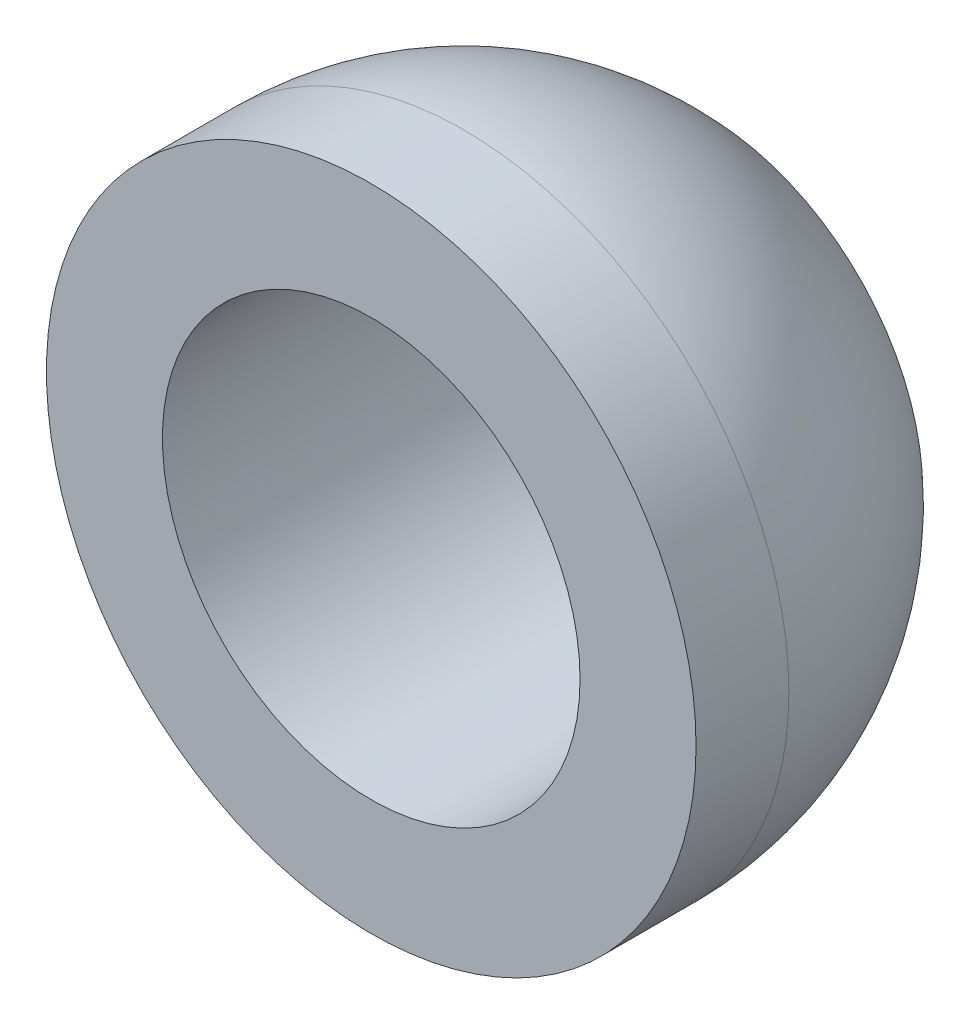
ISO-10303-21;
HEADER;
FILE_DESCRIPTION(('STEP AP214'),'2;1');
FILE_NAME('part.step','',(''),(''),'','','');
FILE_SCHEMA(('AUTOMOTIVE_DESIGN { 1 0 10303 214 1 1 1 1 }'));
ENDSEC;
DATA;
#1=APPLICATION_CONTEXT('core data for automotive mechanical design processes');
#2=APPLICATION_PROTOCOL_DEFINITION('international standard','automotive_design',2000,#1);
#3=PRODUCT_CONTEXT('',#1,'mechanical');
#4=PRODUCT('Part','Part','',(#3));
#5=PRODUCT_RELATED_PRODUCT_CATEGORY('part','',(#4));
#6=PRODUCT_DEFINITION_FORMATION('','',#4);
#7=PRODUCT_DEFINITION_CONTEXT('part definition',#1,'design');
#8=PRODUCT_DEFINITION('design','',#6,#7);
#9=PRODUCT_DEFINITION_SHAPE('','',#8);
#10=(LENGTH_UNIT() NAMED_UNIT(*) SI_UNIT(.MILLI.,.METRE.));
#11=(NAMED_UNIT(*) PLANE_ANGLE_UNIT() SI_UNIT($,.RADIAN.));
#12=(NAMED_UNIT(*) SI_UNIT($,.STERADIAN.) SOLID_ANGLE_UNIT());
#13=UNCERTAINTY_MEASURE_WITH_UNIT(LENGTH_MEASURE(1.E-05),#10,'distance_accuracy_value','');
#14=(GEOMETRIC_REPRESENTATION_CONTEXT(3) GLOBAL_UNCERTAINTY_ASSIGNED_CONTEXT((#13)) GLOBAL_UNIT_ASSIGNED_CONTEXT((#10,
#11,#12)) REPRESENTATION_CONTEXT('',''));
#15=CARTESIAN_POINT('',(0.,0.,0.));
#16=DIRECTION('',(0.,0.,1.));
#17=DIRECTION('',(1.,0.,0.));
#18=AXIS2_PLACEMENT_3D('',#15,#16,#17);
#19=CARTESIAN_POINT('',(0.,2.25,0.));
#20=DIRECTION('',(0.,0.,-1.));
#21=DIRECTION('',(-1.,0.,0.));
#22=AXIS2_PLACEMENT_3D('',#19,#20,#21);
#23=PLANE('',#22);
#24=CARTESIAN_POINT('',(0.,0.,0.));
#25=DIRECTION('',(0.,0.,1.));
#26=DIRECTION('',(1.,0.,0.));
#27=AXIS2_PLACEMENT_3D('',#24,#25,#26);
#28=CIRCLE('',#27,2.25);
#29=CARTESIAN_POINT('',(2.25,0.,0.));
#30=VERTEX_POINT('',#29);
#31=EDGE_CURVE('E10',#30,#30,#28,.T.);
#32=ORIENTED_EDGE('',*,*,#31,.F.);
#33=EDGE_LOOP('',(#32));
#34=FACE_BOUND('',#33,.T.);
#35=CARTESIAN_POINT('',(0.,0.,0.));
#36=DIRECTION('',(0.,0.,1.));
#37=DIRECTION('',(1.,0.,0.));
#38=AXIS2_PLACEMENT_3D('',#35,#36,#37);
#39=CIRCLE('',#38,3.5);
#40=CARTESIAN_POINT('',(3.5,0.,0.));
#41=VERTEX_POINT('',#40);
#42=EDGE_CURVE('E36',#41,#41,#39,.T.);
#43=ORIENTED_EDGE('',*,*,#42,.T.);
#44=EDGE_LOOP('',(#43));
#45=FACE_BOUND('',#44,.T.);
#46=ADVANCED_FACE('F25',(#34,#45),#23,.F.);
#47=CARTESIAN_POINT('',(0.,0.,0.));
#48=DIRECTION('',(0.,0.,1.));
#49=DIRECTION('',(1.,0.,0.));
#50=AXIS2_PLACEMENT_3D('',#47,#48,#49);
#51=CYLINDRICAL_SURFACE('',#50,2.25);
#52=CARTESIAN_POINT('',(0.,0.,-3.6));
#53=DIRECTION('',(0.,0.,1.));
#54=DIRECTION('',(1.,0.,0.));
#55=AXIS2_PLACEMENT_3D('',#52,#53,#54);
#56=CIRCLE('',#55,2.25);
#57=CARTESIAN_POINT('',(2.25,0.,-3.6));
#58=VERTEX_POINT('',#57);
#59=EDGE_CURVE('E41',#58,#58,#56,.F.);
#60=ORIENTED_EDGE('',*,*,#59,.T.);
#61=EDGE_LOOP('',(#60));
#62=FACE_BOUND('',#61,.T.);
#63=ORIENTED_EDGE('',*,*,#31,.T.);
#64=EDGE_LOOP('',(#63));
#65=FACE_BOUND('',#64,.T.);
#66=ADVANCED_FACE('F63',(#62,#65),#51,.F.);
#67=CARTESIAN_POINT('',(0.,0.,-1.));
#68=DIRECTION('',(0.,0.,1.));
#69=DIRECTION('',(0.,1.,0.));
#70=AXIS2_PLACEMENT_3D('',#67,#68,#69);
#71=SPHERICAL_SURFACE('',#70,3.5);
#72=CARTESIAN_POINT('',(0.,0.,-3.6));
#73=DIRECTION('',(0.,0.,1.));
#74=DIRECTION('',(1.,0.,0.));
#75=AXIS2_PLACEMENT_3D('',#72,#73,#74);
#76=CIRCLE('',#75,2.343074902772);
#77=CARTESIAN_POINT('',(2.343074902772,0.,-3.6));
#78=VERTEX_POINT('',#77);
#79=EDGE_CURVE('E28',#78,#78,#76,.T.);
#80=ORIENTED_EDGE('',*,*,#79,.T.);
#81=EDGE_LOOP('',(#80));
#82=FACE_BOUND('',#81,.T.);
#83=CARTESIAN_POINT('',(0.,0.,-1.));
#84=DIRECTION('',(0.,0.,1.));
#85=DIRECTION('',(1.,0.,0.));
#86=AXIS2_PLACEMENT_3D('',#83,#84,#85);
#87=CIRCLE('',#86,3.5);
#88=CARTESIAN_POINT('',(3.5,0.,-1.));
#89=VERTEX_POINT('',#88);
#90=EDGE_CURVE('E32',#89,#89,#87,.T.);
#91=ORIENTED_EDGE('',*,*,#90,.F.);
#92=EDGE_LOOP('',(#91));
#93=FACE_BOUND('',#92,.T.);
#94=ADVANCED_FACE('F48',(#82,#93),#71,.T.);
#95=CARTESIAN_POINT('',(0.,0.,0.));
#96=DIRECTION('',(0.,0.,1.));
#97=DIRECTION('',(1.,0.,0.));
#98=AXIS2_PLACEMENT_3D('',#95,#96,#97);
#99=CYLINDRICAL_SURFACE('',#98,3.5);
#100=ORIENTED_EDGE('',*,*,#42,.F.);
#101=EDGE_LOOP('',(#100));
#102=FACE_BOUND('',#101,.T.);
#103=ORIENTED_EDGE('',*,*,#90,.T.);
#104=EDGE_LOOP('',(#103));
#105=FACE_BOUND('',#104,.T.);
#106=ADVANCED_FACE('F54',(#102,#105),#99,.T.);
#107=CARTESIAN_POINT('',(0.,0.,-3.6));
#108=DIRECTION('',(0.,0.,1.));
#109=DIRECTION('',(1.,0.,0.));
#110=AXIS2_PLACEMENT_3D('',#107,#108,#109);
#111=PLANE('',#110);
#112=ORIENTED_EDGE('',*,*,#79,.F.);
#113=EDGE_LOOP('',(#112));
#114=FACE_BOUND('',#113,.T.);
#115=ORIENTED_EDGE('',*,*,#59,.F.);
#116=EDGE_LOOP('',(#115));
#117=FACE_BOUND('',#116,.T.);
#118=ADVANCED_FACE('F51',(#114,#117),#111,.F.);
#119=CLOSED_SHELL('',(#46,#66,#94,#106,#118));
#120=MANIFOLD_SOLID_BREP('B2',#119);
#121=ADVANCED_BREP_SHAPE_REPRESENTATION('',(#18,#120),#14);
#122=SHAPE_DEFINITION_REPRESENTATION(#9,#121);
ENDSEC;
END-ISO-10303-21;
